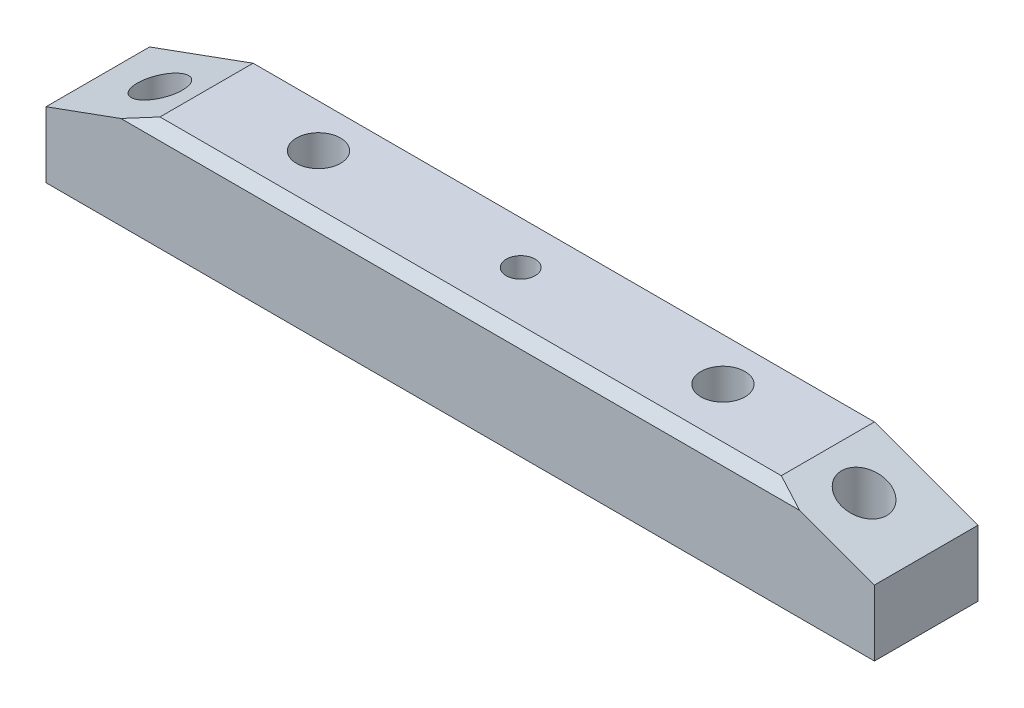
ISO-10303-21;
HEADER;
FILE_DESCRIPTION(('STEP AP214'),'2;1');
FILE_NAME('part.step','',(''),(''),'','','');
FILE_SCHEMA(('AUTOMOTIVE_DESIGN { 1 0 10303 214 1 1 1 1 }'));
ENDSEC;
DATA;
#1=APPLICATION_CONTEXT('core data for automotive mechanical design processes');
#2=APPLICATION_PROTOCOL_DEFINITION('international standard','automotive_design',2000,#1);
#3=PRODUCT_CONTEXT('',#1,'mechanical');
#4=PRODUCT('Part','Part','',(#3));
#5=PRODUCT_RELATED_PRODUCT_CATEGORY('part','',(#4));
#6=PRODUCT_DEFINITION_FORMATION('','',#4);
#7=PRODUCT_DEFINITION_CONTEXT('part definition',#1,'design');
#8=PRODUCT_DEFINITION('design','',#6,#7);
#9=PRODUCT_DEFINITION_SHAPE('','',#8);
#10=(LENGTH_UNIT() NAMED_UNIT(*) SI_UNIT(.MILLI.,.METRE.));
#11=(NAMED_UNIT(*) PLANE_ANGLE_UNIT() SI_UNIT($,.RADIAN.));
#12=(NAMED_UNIT(*) SI_UNIT($,.STERADIAN.) SOLID_ANGLE_UNIT());
#13=UNCERTAINTY_MEASURE_WITH_UNIT(LENGTH_MEASURE(1.E-05),#10,'distance_accuracy_value','');
#14=(GEOMETRIC_REPRESENTATION_CONTEXT(3) GLOBAL_UNCERTAINTY_ASSIGNED_CONTEXT((#13)) GLOBAL_UNIT_ASSIGNED_CONTEXT((#10,
#11,#12)) REPRESENTATION_CONTEXT('',''));
#15=CARTESIAN_POINT('',(0.,0.,0.));
#16=DIRECTION('',(0.,0.,1.));
#17=DIRECTION('',(1.,0.,0.));
#18=AXIS2_PLACEMENT_3D('',#15,#16,#17);
#19=CARTESIAN_POINT('',(-27.6225,9.525,0.));
#20=DIRECTION('',(0.,1.,0.));
#21=DIRECTION('',(0.,0.,1.));
#22=AXIS2_PLACEMENT_3D('',#19,#20,#21);
#23=PLANE('',#22);
#24=CARTESIAN_POINT('',(-31.0007,9.525,0.));
#25=DIRECTION('',(0.,-1.,0.));
#26=DIRECTION('',(0.,0.,-1.));
#27=AXIS2_PLACEMENT_3D('',#24,#25,#26);
#28=CIRCLE('',#27,6.1468);
#29=CARTESIAN_POINT('',(-31.0007,9.525,-6.14679999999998));
#30=VERTEX_POINT('',#29);
#31=EDGE_CURVE('E19',#30,#30,#28,.T.);
#32=ORIENTED_EDGE('',*,*,#31,.T.);
#33=EDGE_LOOP('',(#32));
#34=FACE_BOUND('',#33,.T.);
#35=CARTESIAN_POINT('',(-31.0007,9.525,0.));
#36=DIRECTION('',(0.,-1.,0.));
#37=DIRECTION('',(0.,0.,-1.));
#38=AXIS2_PLACEMENT_3D('',#35,#36,#37);
#39=CIRCLE('',#38,3.3782);
#40=CARTESIAN_POINT('',(-31.0007,9.525,-3.37819999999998));
#41=VERTEX_POINT('',#40);
#42=EDGE_CURVE('E84',#41,#41,#39,.F.);
#43=ORIENTED_EDGE('',*,*,#42,.T.);
#44=EDGE_LOOP('',(#43));
#45=FACE_BOUND('',#44,.T.);
#46=ADVANCED_FACE('F16',(#34,#45),#23,.F.);
#47=CARTESIAN_POINT('',(34.3789,9.525,0.));
#48=DIRECTION('',(0.,1.,0.));
#49=DIRECTION('',(0.,0.,1.));
#50=AXIS2_PLACEMENT_3D('',#47,#48,#49);
#51=PLANE('',#50);
#52=CARTESIAN_POINT('',(31.0007,9.525,0.));
#53=DIRECTION('',(0.,-1.,0.));
#54=DIRECTION('',(0.,0.,-1.));
#55=AXIS2_PLACEMENT_3D('',#52,#53,#54);
#56=CIRCLE('',#55,6.1468);
#57=CARTESIAN_POINT('',(31.0007,9.525,-6.1468));
#58=VERTEX_POINT('',#57);
#59=EDGE_CURVE('E85',#58,#58,#56,.T.);
#60=ORIENTED_EDGE('',*,*,#59,.T.);
#61=EDGE_LOOP('',(#60));
#62=FACE_BOUND('',#61,.T.);
#63=CARTESIAN_POINT('',(31.0007,9.525,0.));
#64=DIRECTION('',(0.,-1.,0.));
#65=DIRECTION('',(0.,0.,-1.));
#66=AXIS2_PLACEMENT_3D('',#63,#64,#65);
#67=CIRCLE('',#66,3.3782);
#68=CARTESIAN_POINT('',(31.0007,9.525,-3.3782));
#69=VERTEX_POINT('',#68);
#70=EDGE_CURVE('E138',#69,#69,#67,.F.);
#71=ORIENTED_EDGE('',*,*,#70,.T.);
#72=EDGE_LOOP('',(#71));
#73=FACE_BOUND('',#72,.T.);
#74=ADVANCED_FACE('F329',(#62,#73),#51,.F.);
#75=CARTESIAN_POINT('',(0.,9.525,0.));
#76=DIRECTION('',(0.,1.,0.));
#77=DIRECTION('',(0.,0.,1.));
#78=AXIS2_PLACEMENT_3D('',#75,#76,#77);
#79=PLANE('',#78);
#80=CARTESIAN_POINT('',(0.,9.525,0.));
#81=DIRECTION('',(0.,1.,0.));
#82=DIRECTION('',(0.,0.,1.));
#83=AXIS2_PLACEMENT_3D('',#80,#81,#82);
#84=CIRCLE('',#83,2.21386533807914);
#85=CARTESIAN_POINT('',(0.,9.525,2.21386533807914));
#86=VERTEX_POINT('',#85);
#87=EDGE_CURVE('E103',#86,#86,#84,.T.);
#88=ORIENTED_EDGE('',*,*,#87,.T.);
#89=EDGE_LOOP('',(#88));
#90=FACE_BOUND('',#89,.T.);
#91=ADVANCED_FACE('F164',(#90),#79,.T.);
#92=CARTESIAN_POINT('',(-53.975,0.,1.33349999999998));
#93=DIRECTION('',(0.,-1.,0.));
#94=DIRECTION('',(0.,0.,-1.));
#95=AXIS2_PLACEMENT_3D('',#92,#93,#94);
#96=CYLINDRICAL_SURFACE('',#95,3.45439999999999);
#97=CARTESIAN_POINT('',(-53.975,0.,1.33349999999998));
#98=DIRECTION('',(0.,-1.,0.));
#99=DIRECTION('',(0.,0.,-1.));
#100=AXIS2_PLACEMENT_3D('',#97,#98,#99);
#101=CIRCLE('',#100,3.45439999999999);
#102=CARTESIAN_POINT('',(-53.975,0.,-2.1209));
#103=VERTEX_POINT('',#102);
#104=EDGE_CURVE('E132',#103,#103,#101,.F.);
#105=ORIENTED_EDGE('',*,*,#104,.F.);
#106=EDGE_LOOP('',(#105));
#107=FACE_BOUND('',#106,.T.);
#108=CARTESIAN_POINT('',(-53.975,13.5637890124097,1.33349999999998));
#109=DIRECTION('',(0.342020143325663,-0.93969262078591,0.));
#110=DIRECTION('',(-0.93969262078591,-0.342020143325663,0.));
#111=AXIS2_PLACEMENT_3D('',#108,#109,#110);
#112=ELLIPSE('',#111,3.67609569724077,3.45439999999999);
#113=CARTESIAN_POINT('',(-57.4294,12.3064902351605,1.33349999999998));
#114=VERTEX_POINT('',#113);
#115=EDGE_CURVE('E100',#114,#114,#112,.F.);
#116=ORIENTED_EDGE('',*,*,#115,.T.);
#117=EDGE_LOOP('',(#116));
#118=FACE_BOUND('',#117,.T.);
#119=ADVANCED_FACE('F153',(#107,#118),#96,.F.);
#120=CARTESIAN_POINT('',(-31.0007,0.,0.));
#121=DIRECTION('',(0.,-1.,0.));
#122=DIRECTION('',(0.,0.,-1.));
#123=AXIS2_PLACEMENT_3D('',#120,#121,#122);
#124=CYLINDRICAL_SURFACE('',#123,6.1468);
#125=CARTESIAN_POINT('',(-31.0007,0.,0.));
#126=DIRECTION('',(0.,-1.,0.));
#127=DIRECTION('',(0.,0.,-1.));
#128=AXIS2_PLACEMENT_3D('',#125,#126,#127);
#129=CIRCLE('',#128,6.1468);
#130=CARTESIAN_POINT('',(-31.0007,0.,-6.14679999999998));
#131=VERTEX_POINT('',#130);
#132=EDGE_CURVE('E126',#131,#131,#129,.F.);
#133=ORIENTED_EDGE('',*,*,#132,.F.);
#134=EDGE_LOOP('',(#133));
#135=FACE_BOUND('',#134,.T.);
#136=ORIENTED_EDGE('',*,*,#31,.F.);
#137=EDGE_LOOP('',(#136));
#138=FACE_BOUND('',#137,.T.);
#139=ADVANCED_FACE('F150',(#135,#138),#124,.F.);
#140=CARTESIAN_POINT('',(31.0007,0.,0.));
#141=DIRECTION('',(0.,-1.,0.));
#142=DIRECTION('',(0.,0.,-1.));
#143=AXIS2_PLACEMENT_3D('',#140,#141,#142);
#144=CYLINDRICAL_SURFACE('',#143,6.1468);
#145=CARTESIAN_POINT('',(31.0007,0.,0.));
#146=DIRECTION('',(0.,-1.,0.));
#147=DIRECTION('',(0.,0.,-1.));
#148=AXIS2_PLACEMENT_3D('',#145,#146,#147);
#149=CIRCLE('',#148,6.1468);
#150=CARTESIAN_POINT('',(31.0007,0.,-6.1468));
#151=VERTEX_POINT('',#150);
#152=EDGE_CURVE('E122',#151,#151,#149,.F.);
#153=ORIENTED_EDGE('',*,*,#152,.F.);
#154=EDGE_LOOP('',(#153));
#155=FACE_BOUND('',#154,.T.);
#156=ORIENTED_EDGE('',*,*,#59,.F.);
#157=EDGE_LOOP('',(#156));
#158=FACE_BOUND('',#157,.T.);
#159=ADVANCED_FACE('F152',(#155,#158),#144,.F.);
#160=CARTESIAN_POINT('',(53.975,0.,1.33349999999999));
#161=DIRECTION('',(0.,-1.,0.));
#162=DIRECTION('',(0.,0.,-1.));
#163=AXIS2_PLACEMENT_3D('',#160,#161,#162);
#164=CYLINDRICAL_SURFACE('',#163,3.45439999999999);
#165=CARTESIAN_POINT('',(53.975,13.5637890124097,1.33349999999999));
#166=DIRECTION('',(-0.342020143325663,-0.93969262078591,0.));
#167=DIRECTION('',(0.93969262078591,-0.342020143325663,0.));
#168=AXIS2_PLACEMENT_3D('',#165,#166,#167);
#169=ELLIPSE('',#168,3.67609569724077,3.45439999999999);
#170=CARTESIAN_POINT('',(57.4294,12.3064902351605,1.33349999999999));
#171=VERTEX_POINT('',#170);
#172=EDGE_CURVE('E117',#171,#171,#169,.F.);
#173=ORIENTED_EDGE('',*,*,#172,.T.);
#174=EDGE_LOOP('',(#173));
#175=FACE_BOUND('',#174,.T.);
#176=CARTESIAN_POINT('',(53.975,0.,1.33349999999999));
#177=DIRECTION('',(0.,-1.,0.));
#178=DIRECTION('',(0.,0.,-1.));
#179=AXIS2_PLACEMENT_3D('',#176,#177,#178);
#180=CIRCLE('',#179,3.45439999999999);
#181=CARTESIAN_POINT('',(53.975,0.,-2.12089999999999));
#182=VERTEX_POINT('',#181);
#183=EDGE_CURVE('E129',#182,#182,#180,.F.);
#184=ORIENTED_EDGE('',*,*,#183,.F.);
#185=EDGE_LOOP('',(#184));
#186=FACE_BOUND('',#185,.T.);
#187=ADVANCED_FACE('F161',(#175,#186),#164,.F.);
#188=CARTESIAN_POINT('',(0.,0.,9.271));
#189=DIRECTION('',(0.,0.,1.));
#190=DIRECTION('',(1.,0.,0.));
#191=AXIS2_PLACEMENT_3D('',#188,#189,#190);
#192=PLANE('',#191);
#193=DIRECTION('',(1.,0.,0.));
#194=VECTOR('',#193,1.);
#195=CARTESIAN_POINT('',(-63.5,0.,9.271));
#196=LINE('',#195,#194);
#197=CARTESIAN_POINT('',(63.5,0.,9.271));
#198=VERTEX_POINT('',#197);
#199=CARTESIAN_POINT('',(-63.5,0.,9.271));
#200=VERTEX_POINT('',#199);
#201=EDGE_CURVE('E125',#198,#200,#196,.F.);
#202=ORIENTED_EDGE('',*,*,#201,.F.);
#203=DIRECTION('',(0.,1.,0.));
#204=VECTOR('',#203,1.);
#205=CARTESIAN_POINT('',(63.5,15.875,9.271));
#206=LINE('',#205,#204);
#207=CARTESIAN_POINT('',(63.5,10.0969725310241,9.271));
#208=VERTEX_POINT('',#207);
#209=EDGE_CURVE('E374',#208,#198,#206,.F.);
#210=ORIENTED_EDGE('',*,*,#209,.F.);
#211=DIRECTION('',(0.93969262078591,-0.342020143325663,0.));
#212=VECTOR('',#211,1.);
#213=CARTESIAN_POINT('',(47.625,15.875,9.271));
#214=LINE('',#213,#212);
#215=CARTESIAN_POINT('',(52.0215133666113,14.2748,9.271));
#216=VERTEX_POINT('',#215);
#217=EDGE_CURVE('E80',#208,#216,#214,.F.);
#218=ORIENTED_EDGE('',*,*,#217,.T.);
#219=DIRECTION('',(1.,0.,0.));
#220=VECTOR('',#219,1.);
#221=CARTESIAN_POINT('',(0.,14.2748,9.271));
#222=LINE('',#221,#220);
#223=CARTESIAN_POINT('',(-52.0215133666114,14.2748,9.271));
#224=VERTEX_POINT('',#223);
#225=EDGE_CURVE('E76',#216,#224,#222,.F.);
#226=ORIENTED_EDGE('',*,*,#225,.T.);
#227=DIRECTION('',(0.93969262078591,0.342020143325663,0.));
#228=VECTOR('',#227,1.);
#229=CARTESIAN_POINT('',(-63.5,10.0969725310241,9.27100000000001));
#230=LINE('',#229,#228);
#231=CARTESIAN_POINT('',(-63.5,10.0969725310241,9.271));
#232=VERTEX_POINT('',#231);
#233=EDGE_CURVE('E73',#224,#232,#230,.F.);
#234=ORIENTED_EDGE('',*,*,#233,.T.);
#235=DIRECTION('',(0.,1.,0.));
#236=VECTOR('',#235,1.);
#237=CARTESIAN_POINT('',(-63.5,15.875,9.271));
#238=LINE('',#237,#236);
#239=EDGE_CURVE('E134',#200,#232,#238,.T.);
#240=ORIENTED_EDGE('',*,*,#239,.F.);
#241=EDGE_LOOP('',(#202,#210,#218,#226,#234,#240));
#242=FACE_BOUND('',#241,.T.);
#243=ADVANCED_FACE('F78',(#242),#192,.T.);
#244=CARTESIAN_POINT('',(0.,14.2748,9.271));
#245=DIRECTION('',(0.,-0.707106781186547,-0.707106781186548));
#246=DIRECTION('',(0.,0.707106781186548,-0.707106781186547));
#247=AXIS2_PLACEMENT_3D('',#244,#245,#246);
#248=PLANE('',#247);
#249=DIRECTION('',(1.,0.,0.));
#250=VECTOR('',#249,1.);
#251=CARTESIAN_POINT('',(-63.5,15.875,7.67080000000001));
#252=LINE('',#251,#250);
#253=CARTESIAN_POINT('',(-47.625,15.875,7.67080000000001));
#254=VERTEX_POINT('',#253);
#255=CARTESIAN_POINT('',(47.625,15.875,7.6708));
#256=VERTEX_POINT('',#255);
#257=EDGE_CURVE('E99',#254,#256,#252,.T.);
#258=ORIENTED_EDGE('',*,*,#257,.F.);
#259=DIRECTION('',(-0.889126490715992,-0.32361557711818,0.323615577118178));
#260=VECTOR('',#259,1.);
#261=CARTESIAN_POINT('',(-47.625,15.875,7.67080000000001));
#262=LINE('',#261,#260);
#263=EDGE_CURVE('E92',#254,#224,#262,.T.);
#264=ORIENTED_EDGE('',*,*,#263,.T.);
#265=ORIENTED_EDGE('',*,*,#225,.F.);
#266=DIRECTION('',(-0.889126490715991,0.32361557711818,-0.323615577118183));
#267=VECTOR('',#266,1.);
#268=CARTESIAN_POINT('',(52.0215133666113,14.2748,9.271));
#269=LINE('',#268,#267);
#270=EDGE_CURVE('E365',#216,#256,#269,.T.);
#271=ORIENTED_EDGE('',*,*,#270,.T.);
#272=EDGE_LOOP('',(#258,#264,#265,#271));
#273=FACE_BOUND('',#272,.T.);
#274=ADVANCED_FACE('F98',(#273),#248,.F.);
#275=CARTESIAN_POINT('',(-31.0007,0.,0.));
#276=DIRECTION('',(0.,-1.,0.));
#277=DIRECTION('',(0.,0.,-1.));
#278=AXIS2_PLACEMENT_3D('',#275,#276,#277);
#279=CYLINDRICAL_SURFACE('',#278,3.3782);
#280=CARTESIAN_POINT('',(-31.0007,15.875,0.));
#281=DIRECTION('',(0.,-1.,0.));
#282=DIRECTION('',(0.,0.,-1.));
#283=AXIS2_PLACEMENT_3D('',#280,#281,#282);
#284=CIRCLE('',#283,3.3782);
#285=CARTESIAN_POINT('',(-31.0007,15.875,-3.37819999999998));
#286=VERTEX_POINT('',#285);
#287=EDGE_CURVE('E114',#286,#286,#284,.T.);
#288=ORIENTED_EDGE('',*,*,#287,.F.);
#289=EDGE_LOOP('',(#288));
#290=FACE_BOUND('',#289,.T.);
#291=ORIENTED_EDGE('',*,*,#42,.F.);
#292=EDGE_LOOP('',(#291));
#293=FACE_BOUND('',#292,.T.);
#294=ADVANCED_FACE('F205',(#290,#293),#279,.F.);
#295=CARTESIAN_POINT('',(31.0007,0.,0.));
#296=DIRECTION('',(0.,-1.,0.));
#297=DIRECTION('',(0.,0.,-1.));
#298=AXIS2_PLACEMENT_3D('',#295,#296,#297);
#299=CYLINDRICAL_SURFACE('',#298,3.3782);
#300=CARTESIAN_POINT('',(31.0007,15.875,0.));
#301=DIRECTION('',(0.,-1.,0.));
#302=DIRECTION('',(0.,0.,-1.));
#303=AXIS2_PLACEMENT_3D('',#300,#301,#302);
#304=CIRCLE('',#303,3.3782);
#305=CARTESIAN_POINT('',(31.0007,15.875,-3.3782));
#306=VERTEX_POINT('',#305);
#307=EDGE_CURVE('E111',#306,#306,#304,.T.);
#308=ORIENTED_EDGE('',*,*,#307,.F.);
#309=EDGE_LOOP('',(#308));
#310=FACE_BOUND('',#309,.T.);
#311=ORIENTED_EDGE('',*,*,#70,.F.);
#312=EDGE_LOOP('',(#311));
#313=FACE_BOUND('',#312,.T.);
#314=ADVANCED_FACE('F201',(#310,#313),#299,.F.);
#315=CARTESIAN_POINT('',(0.,9.525,0.));
#316=DIRECTION('',(0.,1.,0.));
#317=DIRECTION('',(0.,0.,1.));
#318=AXIS2_PLACEMENT_3D('',#315,#316,#317);
#319=CYLINDRICAL_SURFACE('',#318,2.21386533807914);
#320=CARTESIAN_POINT('',(0.,15.875,0.));
#321=DIRECTION('',(0.,1.,0.));
#322=DIRECTION('',(0.,0.,1.));
#323=AXIS2_PLACEMENT_3D('',#320,#321,#322);
#324=CIRCLE('',#323,2.21386533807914);
#325=CARTESIAN_POINT('',(0.,15.875,2.21386533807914));
#326=VERTEX_POINT('',#325);
#327=EDGE_CURVE('E107',#326,#326,#324,.F.);
#328=ORIENTED_EDGE('',*,*,#327,.F.);
#329=EDGE_LOOP('',(#328));
#330=FACE_BOUND('',#329,.T.);
#331=ORIENTED_EDGE('',*,*,#87,.F.);
#332=EDGE_LOOP('',(#331));
#333=FACE_BOUND('',#332,.T.);
#334=ADVANCED_FACE('F198',(#330,#333),#319,.F.);
#335=CARTESIAN_POINT('',(-63.5,10.0969725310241,-6.605));
#336=DIRECTION('',(0.342020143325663,-0.93969262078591,0.));
#337=DIRECTION('',(0.93969262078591,0.342020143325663,0.));
#338=AXIS2_PLACEMENT_3D('',#335,#336,#337);
#339=PLANE('',#338);
#340=DIRECTION('',(0.,0.,1.));
#341=VECTOR('',#340,1.);
#342=CARTESIAN_POINT('',(-63.5,10.0969725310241,-6.604));
#343=LINE('',#342,#341);
#344=CARTESIAN_POINT('',(-63.5,10.0969725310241,-6.604));
#345=VERTEX_POINT('',#344);
#346=EDGE_CURVE('E95',#232,#345,#343,.F.);
#347=ORIENTED_EDGE('',*,*,#346,.F.);
#348=ORIENTED_EDGE('',*,*,#233,.F.);
#349=ORIENTED_EDGE('',*,*,#263,.F.);
#350=DIRECTION('',(0.,0.,1.));
#351=VECTOR('',#350,1.);
#352=CARTESIAN_POINT('',(-47.625,15.875,-6.604));
#353=LINE('',#352,#351);
#354=CARTESIAN_POINT('',(-47.625,15.875,-6.604));
#355=VERTEX_POINT('',#354);
#356=EDGE_CURVE('E362',#355,#254,#353,.T.);
#357=ORIENTED_EDGE('',*,*,#356,.F.);
#358=DIRECTION('',(-0.93969262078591,-0.342020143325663,0.));
#359=VECTOR('',#358,1.);
#360=CARTESIAN_POINT('',(-47.625,15.875,-6.604));
#361=LINE('',#360,#359);
#362=EDGE_CURVE('E110',#355,#345,#361,.T.);
#363=ORIENTED_EDGE('',*,*,#362,.T.);
#364=EDGE_LOOP('',(#347,#348,#349,#357,#363));
#365=FACE_BOUND('',#364,.T.);
#366=ORIENTED_EDGE('',*,*,#115,.F.);
#367=EDGE_LOOP('',(#366));
#368=FACE_BOUND('',#367,.T.);
#369=ADVANCED_FACE('F89',(#365,#368),#339,.F.);
#370=CARTESIAN_POINT('',(-63.5,15.875,-6.604));
#371=DIRECTION('',(-1.,0.,0.));
#372=DIRECTION('',(0.,0.,1.));
#373=AXIS2_PLACEMENT_3D('',#370,#371,#372);
#374=PLANE('',#373);
#375=DIRECTION('',(0.,0.,-1.));
#376=VECTOR('',#375,1.);
#377=CARTESIAN_POINT('',(-63.5,0.,-6.604));
#378=LINE('',#377,#376);
#379=CARTESIAN_POINT('',(-63.5,0.,-6.604));
#380=VERTEX_POINT('',#379);
#381=EDGE_CURVE('E376',#200,#380,#378,.T.);
#382=ORIENTED_EDGE('',*,*,#381,.F.);
#383=ORIENTED_EDGE('',*,*,#239,.T.);
#384=ORIENTED_EDGE('',*,*,#346,.T.);
#385=DIRECTION('',(0.,1.,0.));
#386=VECTOR('',#385,1.);
#387=CARTESIAN_POINT('',(-63.5,0.,-6.604));
#388=LINE('',#387,#386);
#389=EDGE_CURVE('E382',#345,#380,#388,.F.);
#390=ORIENTED_EDGE('',*,*,#389,.T.);
#391=EDGE_LOOP('',(#382,#383,#384,#390));
#392=FACE_BOUND('',#391,.T.);
#393=ADVANCED_FACE('F191',(#392),#374,.T.);
#394=CARTESIAN_POINT('',(-63.5,0.,-6.604));
#395=DIRECTION('',(0.,-1.,0.));
#396=DIRECTION('',(0.,0.,-1.));
#397=AXIS2_PLACEMENT_3D('',#394,#395,#396);
#398=PLANE('',#397);
#399=ORIENTED_EDGE('',*,*,#381,.T.);
#400=DIRECTION('',(1.,0.,0.));
#401=VECTOR('',#400,1.);
#402=CARTESIAN_POINT('',(0.,0.,-6.604));
#403=LINE('',#402,#401);
#404=CARTESIAN_POINT('',(63.5,0.,-6.604));
#405=VERTEX_POINT('',#404);
#406=EDGE_CURVE('E386',#380,#405,#403,.T.);
#407=ORIENTED_EDGE('',*,*,#406,.T.);
#408=DIRECTION('',(0.,0.,-1.));
#409=VECTOR('',#408,1.);
#410=CARTESIAN_POINT('',(63.5,0.,-6.604));
#411=LINE('',#410,#409);
#412=EDGE_CURVE('E121',#198,#405,#411,.T.);
#413=ORIENTED_EDGE('',*,*,#412,.F.);
#414=ORIENTED_EDGE('',*,*,#201,.T.);
#415=EDGE_LOOP('',(#399,#407,#413,#414));
#416=FACE_BOUND('',#415,.T.);
#417=ORIENTED_EDGE('',*,*,#152,.T.);
#418=EDGE_LOOP('',(#417));
#419=FACE_BOUND('',#418,.T.);
#420=ORIENTED_EDGE('',*,*,#132,.T.);
#421=EDGE_LOOP('',(#420));
#422=FACE_BOUND('',#421,.T.);
#423=ORIENTED_EDGE('',*,*,#183,.T.);
#424=EDGE_LOOP('',(#423));
#425=FACE_BOUND('',#424,.T.);
#426=ORIENTED_EDGE('',*,*,#104,.T.);
#427=EDGE_LOOP('',(#426));
#428=FACE_BOUND('',#427,.T.);
#429=ADVANCED_FACE('F187',(#416,#419,#422,#425,#428),#398,.T.);
#430=CARTESIAN_POINT('',(63.5,15.875,-6.604));
#431=DIRECTION('',(1.,0.,0.));
#432=DIRECTION('',(0.,0.,-1.));
#433=AXIS2_PLACEMENT_3D('',#430,#431,#432);
#434=PLANE('',#433);
#435=ORIENTED_EDGE('',*,*,#412,.T.);
#436=DIRECTION('',(0.,1.,0.));
#437=VECTOR('',#436,1.);
#438=CARTESIAN_POINT('',(63.5,0.,-6.604));
#439=LINE('',#438,#437);
#440=CARTESIAN_POINT('',(63.5,10.0969725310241,-6.604));
#441=VERTEX_POINT('',#440);
#442=EDGE_CURVE('E390',#405,#441,#439,.T.);
#443=ORIENTED_EDGE('',*,*,#442,.T.);
#444=DIRECTION('',(0.,0.,1.));
#445=VECTOR('',#444,1.);
#446=CARTESIAN_POINT('',(63.5,10.0969725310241,-6.605));
#447=LINE('',#446,#445);
#448=EDGE_CURVE('E120',#441,#208,#447,.T.);
#449=ORIENTED_EDGE('',*,*,#448,.T.);
#450=ORIENTED_EDGE('',*,*,#209,.T.);
#451=EDGE_LOOP('',(#435,#443,#449,#450));
#452=FACE_BOUND('',#451,.T.);
#453=ADVANCED_FACE('F183',(#452),#434,.T.);
#454=CARTESIAN_POINT('',(47.625,15.875,-6.605));
#455=DIRECTION('',(-0.342020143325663,-0.93969262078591,0.));
#456=DIRECTION('',(0.93969262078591,-0.342020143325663,0.));
#457=AXIS2_PLACEMENT_3D('',#454,#455,#456);
#458=PLANE('',#457);
#459=DIRECTION('',(0.,0.,1.));
#460=VECTOR('',#459,1.);
#461=CARTESIAN_POINT('',(47.625,15.875,-6.604));
#462=LINE('',#461,#460);
#463=CARTESIAN_POINT('',(47.625,15.875,-6.604));
#464=VERTEX_POINT('',#463);
#465=EDGE_CURVE('E33',#256,#464,#462,.F.);
#466=ORIENTED_EDGE('',*,*,#465,.F.);
#467=ORIENTED_EDGE('',*,*,#270,.F.);
#468=ORIENTED_EDGE('',*,*,#217,.F.);
#469=ORIENTED_EDGE('',*,*,#448,.F.);
#470=DIRECTION('',(-0.93969262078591,0.342020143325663,0.));
#471=VECTOR('',#470,1.);
#472=CARTESIAN_POINT('',(63.5,10.0969725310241,-6.604));
#473=LINE('',#472,#471);
#474=EDGE_CURVE('E25',#441,#464,#473,.T.);
#475=ORIENTED_EDGE('',*,*,#474,.T.);
#476=EDGE_LOOP('',(#466,#467,#468,#469,#475));
#477=FACE_BOUND('',#476,.T.);
#478=ORIENTED_EDGE('',*,*,#172,.F.);
#479=EDGE_LOOP('',(#478));
#480=FACE_BOUND('',#479,.T.);
#481=ADVANCED_FACE('F176',(#477,#480),#458,.F.);
#482=CARTESIAN_POINT('',(-63.5,15.875,-6.604));
#483=DIRECTION('',(0.,1.,0.));
#484=DIRECTION('',(0.,0.,1.));
#485=AXIS2_PLACEMENT_3D('',#482,#483,#484);
#486=PLANE('',#485);
#487=ORIENTED_EDGE('',*,*,#327,.T.);
#488=EDGE_LOOP('',(#487));
#489=FACE_BOUND('',#488,.T.);
#490=ORIENTED_EDGE('',*,*,#307,.T.);
#491=EDGE_LOOP('',(#490));
#492=FACE_BOUND('',#491,.T.);
#493=ORIENTED_EDGE('',*,*,#287,.T.);
#494=EDGE_LOOP('',(#493));
#495=FACE_BOUND('',#494,.T.);
#496=ORIENTED_EDGE('',*,*,#356,.T.);
#497=ORIENTED_EDGE('',*,*,#257,.T.);
#498=ORIENTED_EDGE('',*,*,#465,.T.);
#499=DIRECTION('',(1.,0.,0.));
#500=VECTOR('',#499,1.);
#501=CARTESIAN_POINT('',(0.,15.875,-6.604));
#502=LINE('',#501,#500);
#503=EDGE_CURVE('E11',#464,#355,#502,.F.);
#504=ORIENTED_EDGE('',*,*,#503,.T.);
#505=EDGE_LOOP('',(#496,#497,#498,#504));
#506=FACE_BOUND('',#505,.T.);
#507=ADVANCED_FACE('F170',(#489,#492,#495,#506),#486,.T.);
#508=CARTESIAN_POINT('',(0.,0.,-6.604));
#509=DIRECTION('',(0.,0.,1.));
#510=DIRECTION('',(1.,0.,0.));
#511=AXIS2_PLACEMENT_3D('',#508,#509,#510);
#512=PLANE('',#511);
#513=ORIENTED_EDGE('',*,*,#474,.F.);
#514=ORIENTED_EDGE('',*,*,#442,.F.);
#515=ORIENTED_EDGE('',*,*,#406,.F.);
#516=ORIENTED_EDGE('',*,*,#389,.F.);
#517=ORIENTED_EDGE('',*,*,#362,.F.);
#518=ORIENTED_EDGE('',*,*,#503,.F.);
#519=EDGE_LOOP('',(#513,#514,#515,#516,#517,#518));
#520=FACE_BOUND('',#519,.T.);
#521=ADVANCED_FACE('F168',(#520),#512,.F.);
#522=CLOSED_SHELL('',(#46,#74,#91,#119,#139,#159,#187,#243,#274,#294,#314,#334,#369,#393,#429,
#453,#481,#507,#521));
#523=MANIFOLD_SOLID_BREP('B1',#522);
#524=ADVANCED_BREP_SHAPE_REPRESENTATION('',(#18,#523),#14);
#525=SHAPE_DEFINITION_REPRESENTATION(#9,#524);
ENDSEC;
END-ISO-10303-21;
